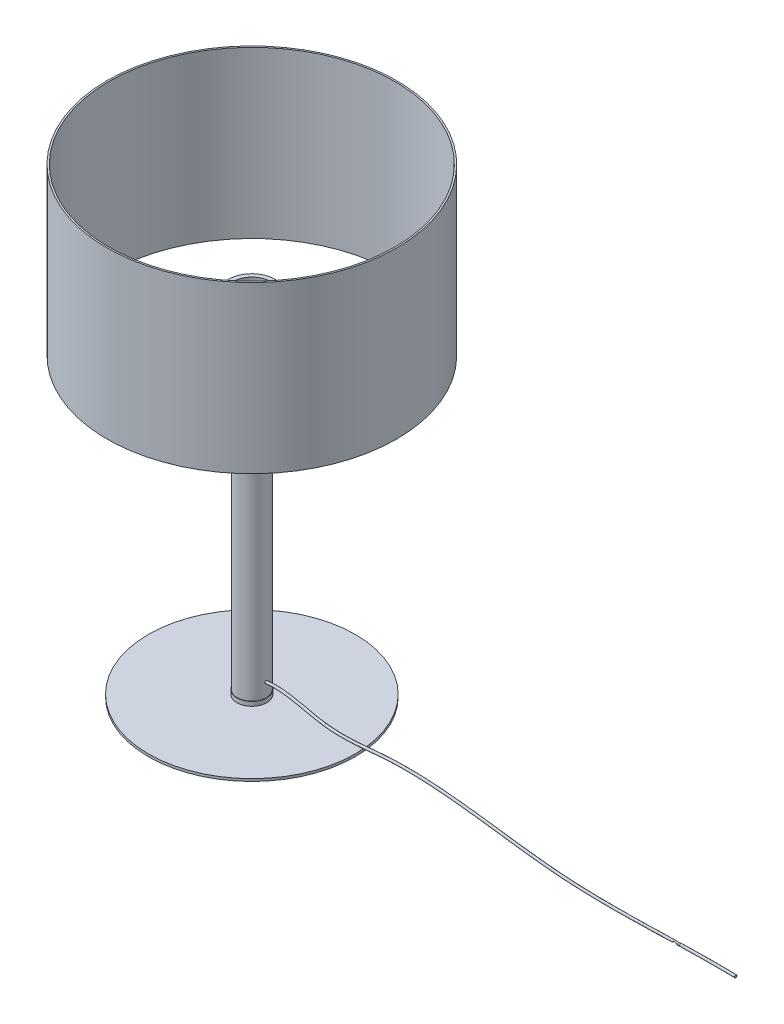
ISO-10303-21;
HEADER;
FILE_DESCRIPTION(('STEP AP214'),'2;1');
FILE_NAME('part.step','',(''),(''),'','','');
FILE_SCHEMA(('AUTOMOTIVE_DESIGN { 1 0 10303 214 1 1 1 1 }'));
ENDSEC;
DATA;
#1=APPLICATION_CONTEXT('core data for automotive mechanical design processes');
#2=APPLICATION_PROTOCOL_DEFINITION('international standard','automotive_design',2000,#1);
#3=PRODUCT_CONTEXT('',#1,'mechanical');
#4=PRODUCT('Part','Part','',(#3));
#5=PRODUCT_RELATED_PRODUCT_CATEGORY('part','',(#4));
#6=PRODUCT_DEFINITION_FORMATION('','',#4);
#7=PRODUCT_DEFINITION_CONTEXT('part definition',#1,'design');
#8=PRODUCT_DEFINITION('design','',#6,#7);
#9=PRODUCT_DEFINITION_SHAPE('','',#8);
#10=(LENGTH_UNIT() NAMED_UNIT(*) SI_UNIT(.MILLI.,.METRE.));
#11=(NAMED_UNIT(*) PLANE_ANGLE_UNIT() SI_UNIT($,.RADIAN.));
#12=(NAMED_UNIT(*) SI_UNIT($,.STERADIAN.) SOLID_ANGLE_UNIT());
#13=UNCERTAINTY_MEASURE_WITH_UNIT(LENGTH_MEASURE(1.E-05),#10,'distance_accuracy_value','');
#14=(GEOMETRIC_REPRESENTATION_CONTEXT(3) GLOBAL_UNCERTAINTY_ASSIGNED_CONTEXT((#13)) GLOBAL_UNIT_ASSIGNED_CONTEXT((#10,
#11,#12)) REPRESENTATION_CONTEXT('',''));
#15=CARTESIAN_POINT('',(0.,0.,0.));
#16=DIRECTION('',(0.,0.,1.));
#17=DIRECTION('',(1.,0.,0.));
#18=AXIS2_PLACEMENT_3D('',#15,#16,#17);
#19=CARTESIAN_POINT('',(-16.6050794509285,407.617185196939,353.));
#20=DIRECTION('',(0.,1.,0.));
#21=DIRECTION('',(0.052935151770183,0.,0.998597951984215));
#22=AXIS2_PLACEMENT_3D('',#19,#20,#21);
#23=PLANE('',#22);
#24=CARTESIAN_POINT('',(-16.6050794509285,407.617185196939,353.));
#25=DIRECTION('',(0.,1.,0.));
#26=DIRECTION('',(0.052935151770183,0.,0.998597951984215));
#27=AXIS2_PLACEMENT_3D('',#24,#25,#26);
#28=CIRCLE('',#27,175.);
#29=CARTESIAN_POINT('',(-7.34142789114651,407.617185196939,527.754641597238));
#30=VERTEX_POINT('',#29);
#31=EDGE_CURVE('P0_E9',#30,#30,#28,.T.);
#32=ORIENTED_EDGE('',*,*,#31,.T.);
#33=EDGE_LOOP('',(#32));
#34=FACE_BOUND('',#33,.T.);
#35=CARTESIAN_POINT('',(-16.6050794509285,407.617185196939,353.));
#36=DIRECTION('',(0.,1.,0.));
#37=DIRECTION('',(0.052935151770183,0.,0.998597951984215));
#38=AXIS2_PLACEMENT_3D('',#35,#36,#37);
#39=CIRCLE('',#38,173.);
#40=CARTESIAN_POINT('',(-7.44729819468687,407.617185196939,525.757445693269));
#41=VERTEX_POINT('',#40);
#42=EDGE_CURVE('P0_E25',#41,#41,#39,.T.);
#43=ORIENTED_EDGE('',*,*,#42,.F.);
#44=EDGE_LOOP('',(#43));
#45=FACE_BOUND('',#44,.T.);
#46=ADVANCED_FACE('P0_F14',(#34,#45),#23,.T.);
#47=CARTESIAN_POINT('',(-16.6050794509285,207.617185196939,353.));
#48=DIRECTION('',(0.,1.,0.));
#49=DIRECTION('',(0.052935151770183,0.,0.998597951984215));
#50=AXIS2_PLACEMENT_3D('',#47,#48,#49);
#51=PLANE('',#50);
#52=CARTESIAN_POINT('',(-16.6050794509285,207.617185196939,353.));
#53=DIRECTION('',(0.,1.,0.));
#54=DIRECTION('',(0.052935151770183,0.,0.998597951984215));
#55=AXIS2_PLACEMENT_3D('',#52,#53,#54);
#56=CIRCLE('',#55,175.);
#57=CARTESIAN_POINT('',(-7.34142789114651,207.617185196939,527.754641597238));
#58=VERTEX_POINT('',#57);
#59=EDGE_CURVE('P0_E18',#58,#58,#56,.T.);
#60=ORIENTED_EDGE('',*,*,#59,.F.);
#61=EDGE_LOOP('',(#60));
#62=FACE_BOUND('',#61,.T.);
#63=CARTESIAN_POINT('',(-16.6050794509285,207.617185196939,353.));
#64=DIRECTION('',(0.,1.,0.));
#65=DIRECTION('',(0.052935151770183,0.,0.998597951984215));
#66=AXIS2_PLACEMENT_3D('',#63,#64,#65);
#67=CIRCLE('',#66,173.);
#68=CARTESIAN_POINT('',(-7.44729819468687,207.617185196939,525.757445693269));
#69=VERTEX_POINT('',#68);
#70=EDGE_CURVE('P0_E27',#69,#69,#67,.T.);
#71=ORIENTED_EDGE('',*,*,#70,.T.);
#72=EDGE_LOOP('',(#71));
#73=FACE_BOUND('',#72,.T.);
#74=ADVANCED_FACE('P0_F37',(#62,#73),#51,.F.);
#75=CARTESIAN_POINT('',(-16.6050794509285,407.617185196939,353.));
#76=DIRECTION('',(0.,-1.,0.));
#77=DIRECTION('',(-0.052935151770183,0.,-0.998597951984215));
#78=AXIS2_PLACEMENT_3D('',#75,#76,#77);
#79=CYLINDRICAL_SURFACE('',#78,175.);
#80=ORIENTED_EDGE('',*,*,#31,.F.);
#81=EDGE_LOOP('',(#80));
#82=FACE_BOUND('',#81,.T.);
#83=ORIENTED_EDGE('',*,*,#59,.T.);
#84=EDGE_LOOP('',(#83));
#85=FACE_BOUND('',#84,.T.);
#86=ADVANCED_FACE('P0_F16',(#82,#85),#79,.T.);
#87=CARTESIAN_POINT('',(-16.6050794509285,407.617185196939,353.));
#88=DIRECTION('',(0.,-1.,0.));
#89=DIRECTION('',(-0.052935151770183,0.,-0.998597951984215));
#90=AXIS2_PLACEMENT_3D('',#87,#88,#89);
#91=CYLINDRICAL_SURFACE('',#90,173.);
#92=ORIENTED_EDGE('',*,*,#42,.T.);
#93=EDGE_LOOP('',(#92));
#94=FACE_BOUND('',#93,.T.);
#95=ORIENTED_EDGE('',*,*,#70,.F.);
#96=EDGE_LOOP('',(#95));
#97=FACE_BOUND('',#96,.T.);
#98=ADVANCED_FACE('P0_F33',(#94,#97),#91,.F.);
#99=CLOSED_SHELL('',(#46,#74,#86,#98));
#100=MANIFOLD_SOLID_BREP('P0_B1',#99);
#101=CARTESIAN_POINT('',(-16.6050794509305,273.323589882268,353.000000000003));
#102=DIRECTION('',(0.,-1.,0.));
#103=DIRECTION('',(0.,0.,-1.));
#104=AXIS2_PLACEMENT_3D('',#101,#102,#103);
#105=PLANE('',#104);
#106=CARTESIAN_POINT('',(-16.6050794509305,273.323589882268,353.000000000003));
#107=DIRECTION('',(0.,1.,0.));
#108=DIRECTION('',(0.,0.,1.));
#109=AXIS2_PLACEMENT_3D('',#106,#107,#108);
#110=CIRCLE('',#109,23.);
#111=CARTESIAN_POINT('',(-16.6050794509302,273.323589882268,376.000000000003));
#112=VERTEX_POINT('',#111);
#113=EDGE_CURVE('P1_E44',#112,#112,#110,.T.);
#114=ORIENTED_EDGE('',*,*,#113,.F.);
#115=EDGE_LOOP('',(#114));
#116=FACE_BOUND('',#115,.T.);
#117=CARTESIAN_POINT('',(-16.6050794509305,273.323589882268,353.000000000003));
#118=DIRECTION('',(0.,-1.,0.));
#119=DIRECTION('',(0.,0.,-1.));
#120=AXIS2_PLACEMENT_3D('',#117,#118,#119);
#121=CIRCLE('',#120,28.);
#122=CARTESIAN_POINT('',(-16.6050794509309,273.323589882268,325.000000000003));
#123=VERTEX_POINT('',#122);
#124=EDGE_CURVE('P1_E10',#123,#123,#121,.T.);
#125=ORIENTED_EDGE('',*,*,#124,.F.);
#126=EDGE_LOOP('',(#125));
#127=FACE_BOUND('',#126,.T.);
#128=ADVANCED_FACE('P1_F15',(#116,#127),#105,.F.);
#129=CARTESIAN_POINT('',(-16.6050794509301,229.302765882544,353.000000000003));
#130=DIRECTION('',(0.,-1.,0.));
#131=DIRECTION('',(0.,0.,-1.));
#132=AXIS2_PLACEMENT_3D('',#129,#130,#131);
#133=CYLINDRICAL_SURFACE('',#132,28.);
#134=CARTESIAN_POINT('',(-16.6050794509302,239.323589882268,353.000000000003));
#135=DIRECTION('',(0.,-1.,0.));
#136=DIRECTION('',(0.,0.,-1.));
#137=AXIS2_PLACEMENT_3D('',#134,#135,#136);
#138=CIRCLE('',#137,28.);
#139=CARTESIAN_POINT('',(-16.6050794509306,239.323589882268,325.000000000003));
#140=VERTEX_POINT('',#139);
#141=EDGE_CURVE('P1_E21',#140,#140,#138,.T.);
#142=ORIENTED_EDGE('',*,*,#141,.F.);
#143=EDGE_LOOP('',(#142));
#144=FACE_BOUND('',#143,.T.);
#145=ORIENTED_EDGE('',*,*,#124,.T.);
#146=EDGE_LOOP('',(#145));
#147=FACE_BOUND('',#146,.T.);
#148=ADVANCED_FACE('P1_F79',(#144,#147),#133,.T.);
#149=CARTESIAN_POINT('',(-16.6050794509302,239.323589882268,353.000000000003));
#150=DIRECTION('',(0.,-1.,0.));
#151=DIRECTION('',(0.,0.,-1.));
#152=AXIS2_PLACEMENT_3D('',#149,#150,#151);
#153=TOROIDAL_SURFACE('',#152,24.,4.);
#154=CARTESIAN_POINT('',(-16.6050794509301,235.323589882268,353.000000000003));
#155=DIRECTION('',(0.,-1.,0.));
#156=DIRECTION('',(0.,0.,-1.));
#157=AXIS2_PLACEMENT_3D('',#154,#155,#156);
#158=CIRCLE('',#157,24.);
#159=CARTESIAN_POINT('',(-16.6050794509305,235.323589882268,329.000000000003));
#160=VERTEX_POINT('',#159);
#161=EDGE_CURVE('P1_E25',#160,#160,#158,.T.);
#162=ORIENTED_EDGE('',*,*,#161,.F.);
#163=EDGE_LOOP('',(#162));
#164=FACE_BOUND('',#163,.T.);
#165=ORIENTED_EDGE('',*,*,#141,.T.);
#166=EDGE_LOOP('',(#165));
#167=FACE_BOUND('',#166,.T.);
#168=ADVANCED_FACE('P1_F84',(#164,#167),#153,.T.);
#169=CARTESIAN_POINT('',(7.39492054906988,235.323589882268,353.000000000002));
#170=DIRECTION('',(0.,1.,0.));
#171=DIRECTION('',(0.,0.,1.));
#172=AXIS2_PLACEMENT_3D('',#169,#170,#171);
#173=PLANE('',#172);
#174=CARTESIAN_POINT('',(-16.6050794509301,235.323589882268,353.000000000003));
#175=DIRECTION('',(0.,-1.,0.));
#176=DIRECTION('',(0.,0.,-1.));
#177=AXIS2_PLACEMENT_3D('',#174,#175,#176);
#178=CIRCLE('',#177,23.);
#179=CARTESIAN_POINT('',(-16.6050794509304,235.323589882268,330.000000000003));
#180=VERTEX_POINT('',#179);
#181=EDGE_CURVE('P1_E29',#180,#180,#178,.T.);
#182=ORIENTED_EDGE('',*,*,#181,.F.);
#183=EDGE_LOOP('',(#182));
#184=FACE_BOUND('',#183,.T.);
#185=ORIENTED_EDGE('',*,*,#161,.T.);
#186=EDGE_LOOP('',(#185));
#187=FACE_BOUND('',#186,.T.);
#188=ADVANCED_FACE('P1_F89',(#184,#187),#173,.F.);
#189=CARTESIAN_POINT('',(-16.6050794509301,235.323589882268,353.000000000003));
#190=DIRECTION('',(0.,1.,0.));
#191=DIRECTION('',(0.,0.,1.));
#192=AXIS2_PLACEMENT_3D('',#189,#190,#191);
#193=CONICAL_SURFACE('',#192,23.,0.0661072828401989);
#194=CARTESIAN_POINT('',(-16.6050794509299,216.60539221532,353.000000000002));
#195=DIRECTION('',(0.,-1.,0.));
#196=DIRECTION('',(0.,0.,-1.));
#197=AXIS2_PLACEMENT_3D('',#194,#195,#196);
#198=CIRCLE('',#197,21.7607850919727);
#199=CARTESIAN_POINT('',(-16.6050794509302,216.60539221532,331.23921490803));
#200=VERTEX_POINT('',#199);
#201=EDGE_CURVE('P1_E34',#200,#200,#198,.T.);
#202=ORIENTED_EDGE('',*,*,#201,.F.);
#203=EDGE_LOOP('',(#202));
#204=FACE_BOUND('',#203,.T.);
#205=ORIENTED_EDGE('',*,*,#181,.T.);
#206=EDGE_LOOP('',(#205));
#207=FACE_BOUND('',#206,.T.);
#208=ADVANCED_FACE('P1_F95',(#204,#207),#193,.T.);
#209=CARTESIAN_POINT('',(-16.6050794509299,216.935687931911,353.000000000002));
#210=DIRECTION('',(0.,-1.,0.));
#211=DIRECTION('',(0.,0.,-1.));
#212=AXIS2_PLACEMENT_3D('',#209,#210,#211);
#213=TOROIDAL_SURFACE('',#212,16.771706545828,5.);
#214=CARTESIAN_POINT('',(-16.6050794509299,214.241434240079,353.000000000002));
#215=DIRECTION('',(0.,-1.,0.));
#216=DIRECTION('',(0.,0.,-1.));
#217=AXIS2_PLACEMENT_3D('',#214,#215,#216);
#218=CIRCLE('',#217,20.9837128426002);
#219=CARTESIAN_POINT('',(-16.6050794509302,214.241434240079,332.016287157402));
#220=VERTEX_POINT('',#219);
#221=EDGE_CURVE('P1_E37',#220,#220,#218,.T.);
#222=ORIENTED_EDGE('',*,*,#221,.F.);
#223=EDGE_LOOP('',(#222));
#224=FACE_BOUND('',#223,.T.);
#225=ORIENTED_EDGE('',*,*,#201,.T.);
#226=EDGE_LOOP('',(#225));
#227=FACE_BOUND('',#226,.T.);
#228=ADVANCED_FACE('P1_F99',(#224,#227),#213,.T.);
#229=CARTESIAN_POINT('',(-16.6050794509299,214.241434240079,353.000000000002));
#230=DIRECTION('',(0.,1.,0.));
#231=DIRECTION('',(0.,0.,1.));
#232=AXIS2_PLACEMENT_3D('',#229,#230,#231);
#233=CONICAL_SURFACE('',#232,20.9837128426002,0.569072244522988);
#234=CARTESIAN_POINT('',(-16.6050794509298,203.323589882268,353.000000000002));
#235=DIRECTION('',(0.,-1.,0.));
#236=DIRECTION('',(0.,0.,-1.));
#237=AXIS2_PLACEMENT_3D('',#234,#235,#236);
#238=CIRCLE('',#237,14.);
#239=CARTESIAN_POINT('',(-16.60507945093,203.323589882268,339.000000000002));
#240=VERTEX_POINT('',#239);
#241=EDGE_CURVE('P1_E40',#240,#240,#238,.T.);
#242=ORIENTED_EDGE('',*,*,#241,.F.);
#243=EDGE_LOOP('',(#242));
#244=FACE_BOUND('',#243,.T.);
#245=ORIENTED_EDGE('',*,*,#221,.T.);
#246=EDGE_LOOP('',(#245));
#247=FACE_BOUND('',#246,.T.);
#248=ADVANCED_FACE('P1_F103',(#244,#247),#233,.T.);
#249=CARTESIAN_POINT('',(-2.60507945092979,203.323589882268,353.000000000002));
#250=DIRECTION('',(0.,1.,0.));
#251=DIRECTION('',(0.,0.,1.));
#252=AXIS2_PLACEMENT_3D('',#249,#250,#251);
#253=PLANE('',#252);
#254=ORIENTED_EDGE('',*,*,#241,.T.);
#255=EDGE_LOOP('',(#254));
#256=FACE_BOUND('',#255,.T.);
#257=ADVANCED_FACE('P1_F73',(#256),#253,.F.);
#258=CARTESIAN_POINT('',(-16.6050794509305,268.323589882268,353.000000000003));
#259=DIRECTION('',(0.,1.,0.));
#260=DIRECTION('',(0.,0.,1.));
#261=AXIS2_PLACEMENT_3D('',#258,#259,#260);
#262=CYLINDRICAL_SURFACE('',#261,23.);
#263=CARTESIAN_POINT('',(-16.6050794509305,268.323589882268,353.000000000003));
#264=DIRECTION('',(0.,1.,0.));
#265=DIRECTION('',(0.,0.,1.));
#266=AXIS2_PLACEMENT_3D('',#263,#264,#265);
#267=CIRCLE('',#266,23.);
#268=CARTESIAN_POINT('',(-16.6050794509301,268.323589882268,376.000000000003));
#269=VERTEX_POINT('',#268);
#270=EDGE_CURVE('P1_E43',#269,#269,#267,.T.);
#271=ORIENTED_EDGE('',*,*,#270,.F.);
#272=EDGE_LOOP('',(#271));
#273=FACE_BOUND('',#272,.T.);
#274=ORIENTED_EDGE('',*,*,#113,.T.);
#275=EDGE_LOOP('',(#274));
#276=FACE_BOUND('',#275,.T.);
#277=ADVANCED_FACE('P1_F67',(#273,#276),#262,.F.);
#278=CARTESIAN_POINT('',(-16.6050794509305,268.323589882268,353.000000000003));
#279=DIRECTION('',(0.,1.,0.));
#280=DIRECTION('',(0.,0.,1.));
#281=AXIS2_PLACEMENT_3D('',#278,#279,#280);
#282=PLANE('',#281);
#283=CARTESIAN_POINT('',(-16.6050794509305,268.323589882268,353.000000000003));
#284=DIRECTION('',(0.,1.,0.));
#285=DIRECTION('',(0.,0.,1.));
#286=AXIS2_PLACEMENT_3D('',#283,#284,#285);
#287=CIRCLE('',#286,12.);
#288=CARTESIAN_POINT('',(-16.6050794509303,268.323589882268,365.000000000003));
#289=VERTEX_POINT('',#288);
#290=EDGE_CURVE('P1_E50',#289,#289,#287,.T.);
#291=ORIENTED_EDGE('',*,*,#290,.F.);
#292=EDGE_LOOP('',(#291));
#293=FACE_BOUND('',#292,.T.);
#294=ORIENTED_EDGE('',*,*,#270,.T.);
#295=EDGE_LOOP('',(#294));
#296=FACE_BOUND('',#295,.T.);
#297=ADVANCED_FACE('P1_F61',(#293,#296),#282,.T.);
#298=CARTESIAN_POINT('',(-16.6050794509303,248.323589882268,353.000000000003));
#299=DIRECTION('',(0.,1.,0.));
#300=DIRECTION('',(0.,0.,1.));
#301=AXIS2_PLACEMENT_3D('',#298,#299,#300);
#302=CYLINDRICAL_SURFACE('',#301,12.);
#303=CARTESIAN_POINT('',(-16.6050794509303,248.323589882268,353.000000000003));
#304=DIRECTION('',(0.,1.,0.));
#305=DIRECTION('',(0.,0.,1.));
#306=AXIS2_PLACEMENT_3D('',#303,#304,#305);
#307=CIRCLE('',#306,12.);
#308=CARTESIAN_POINT('',(-16.6050794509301,248.323589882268,365.000000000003));
#309=VERTEX_POINT('',#308);
#310=EDGE_CURVE('P1_E47',#309,#309,#307,.T.);
#311=ORIENTED_EDGE('',*,*,#310,.F.);
#312=EDGE_LOOP('',(#311));
#313=FACE_BOUND('',#312,.T.);
#314=ORIENTED_EDGE('',*,*,#290,.T.);
#315=EDGE_LOOP('',(#314));
#316=FACE_BOUND('',#315,.T.);
#317=ADVANCED_FACE('P1_F58',(#313,#316),#302,.F.);
#318=CARTESIAN_POINT('',(-16.6050794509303,248.323589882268,353.000000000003));
#319=DIRECTION('',(0.,1.,0.));
#320=DIRECTION('',(0.,0.,1.));
#321=AXIS2_PLACEMENT_3D('',#318,#319,#320);
#322=PLANE('',#321);
#323=ORIENTED_EDGE('',*,*,#310,.T.);
#324=EDGE_LOOP('',(#323));
#325=FACE_BOUND('',#324,.T.);
#326=ADVANCED_FACE('P1_F56',(#325),#322,.T.);
#327=CLOSED_SHELL('',(#128,#148,#168,#188,#208,#228,#248,#257,#277,#297,#317,#326));
#328=MANIFOLD_SOLID_BREP('P1_B1',#327);
#329=CARTESIAN_POINT('',(-56.6050794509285,100.323589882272,353.));
#330=DIRECTION('',(1.,0.,0.));
#331=DIRECTION('',(0.,0.,-1.));
#332=AXIS2_PLACEMENT_3D('',#329,#330,#331);
#333=CYLINDRICAL_SURFACE('',#332,1.5);
#334=CARTESIAN_POINT('',(-56.1050794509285,100.323589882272,353.));
#335=DIRECTION('',(-1.,0.,0.));
#336=DIRECTION('',(0.,0.,1.));
#337=AXIS2_PLACEMENT_3D('',#334,#335,#336);
#338=CIRCLE('',#337,1.5);
#339=CARTESIAN_POINT('',(-56.1050794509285,100.323589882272,351.5));
#340=VERTEX_POINT('',#339);
#341=EDGE_CURVE('P2_E10',#340,#340,#338,.F.);
#342=CARTESIAN_POINT('',(-41.6050794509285,100.323589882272,353.));
#343=DIRECTION('',(-1.,0.,0.));
#344=DIRECTION('',(0.,0.,1.));
#345=AXIS2_PLACEMENT_3D('',#342,#343,#344);
#346=CIRCLE('',#345,1.5);
#347=CARTESIAN_POINT('',(-41.6050794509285,100.323589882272,351.5));
#348=VERTEX_POINT('',#347);
#349=EDGE_CURVE('P2_E26',#348,#348,#346,.T.);
#350=CARTESIAN_POINT('',(-56.1050794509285,100.323589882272,351.5));
#351=CARTESIAN_POINT('',(-55.9540377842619,100.323589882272,351.5));
#352=CARTESIAN_POINT('',(-55.8029961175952,100.323589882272,351.5));
#353=CARTESIAN_POINT('',(-55.5009127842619,100.323589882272,351.5));
#354=CARTESIAN_POINT('',(-55.3498711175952,100.323589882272,351.5));
#355=CARTESIAN_POINT('',(-55.0477877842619,100.323589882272,351.5));
#356=CARTESIAN_POINT('',(-54.8967461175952,100.323589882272,351.5));
#357=CARTESIAN_POINT('',(-54.5946627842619,100.323589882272,351.5));
#358=CARTESIAN_POINT('',(-54.4436211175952,100.323589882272,351.5));
#359=CARTESIAN_POINT('',(-54.1415377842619,100.323589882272,351.5));
#360=CARTESIAN_POINT('',(-53.9904961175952,100.323589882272,351.5));
#361=CARTESIAN_POINT('',(-53.6884127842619,100.323589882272,351.5));
#362=CARTESIAN_POINT('',(-53.5373711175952,100.323589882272,351.5));
#363=CARTESIAN_POINT('',(-53.2352877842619,100.323589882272,351.5));
#364=CARTESIAN_POINT('',(-53.0842461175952,100.323589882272,351.5));
#365=CARTESIAN_POINT('',(-52.7821627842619,100.323589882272,351.5));
#366=CARTESIAN_POINT('',(-52.6311211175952,100.323589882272,351.5));
#367=CARTESIAN_POINT('',(-52.3290377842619,100.323589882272,351.5));
#368=CARTESIAN_POINT('',(-52.1779961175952,100.323589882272,351.5));
#369=CARTESIAN_POINT('',(-51.8759127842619,100.323589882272,351.5));
#370=CARTESIAN_POINT('',(-51.7248711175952,100.323589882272,351.5));
#371=CARTESIAN_POINT('',(-51.4227877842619,100.323589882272,351.5));
#372=CARTESIAN_POINT('',(-51.2717461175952,100.323589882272,351.5));
#373=CARTESIAN_POINT('',(-50.9696627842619,100.323589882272,351.5));
#374=CARTESIAN_POINT('',(-50.8186211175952,100.323589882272,351.5));
#375=CARTESIAN_POINT('',(-50.5165377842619,100.323589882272,351.5));
#376=CARTESIAN_POINT('',(-50.3654961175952,100.323589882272,351.5));
#377=CARTESIAN_POINT('',(-50.0634127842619,100.323589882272,351.5));
#378=CARTESIAN_POINT('',(-49.9123711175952,100.323589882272,351.5));
#379=CARTESIAN_POINT('',(-49.6102877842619,100.323589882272,351.5));
#380=CARTESIAN_POINT('',(-49.4592461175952,100.323589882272,351.5));
#381=CARTESIAN_POINT('',(-49.1571627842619,100.323589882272,351.5));
#382=CARTESIAN_POINT('',(-49.0061211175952,100.323589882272,351.5));
#383=CARTESIAN_POINT('',(-48.7040377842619,100.323589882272,351.5));
#384=CARTESIAN_POINT('',(-48.5529961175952,100.323589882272,351.5));
#385=CARTESIAN_POINT('',(-48.2509127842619,100.323589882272,351.5));
#386=CARTESIAN_POINT('',(-48.0998711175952,100.323589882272,351.5));
#387=CARTESIAN_POINT('',(-47.7977877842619,100.323589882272,351.5));
#388=CARTESIAN_POINT('',(-47.6467461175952,100.323589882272,351.5));
#389=CARTESIAN_POINT('',(-47.3446627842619,100.323589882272,351.5));
#390=CARTESIAN_POINT('',(-47.1936211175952,100.323589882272,351.5));
#391=CARTESIAN_POINT('',(-46.8915377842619,100.323589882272,351.5));
#392=CARTESIAN_POINT('',(-46.7404961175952,100.323589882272,351.5));
#393=CARTESIAN_POINT('',(-46.4384127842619,100.323589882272,351.5));
#394=CARTESIAN_POINT('',(-46.2873711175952,100.323589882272,351.5));
#395=CARTESIAN_POINT('',(-45.9852877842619,100.323589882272,351.5));
#396=CARTESIAN_POINT('',(-45.8342461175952,100.323589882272,351.5));
#397=CARTESIAN_POINT('',(-45.5321627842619,100.323589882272,351.5));
#398=CARTESIAN_POINT('',(-45.3811211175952,100.323589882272,351.5));
#399=CARTESIAN_POINT('',(-45.0790377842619,100.323589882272,351.5));
#400=CARTESIAN_POINT('',(-44.9279961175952,100.323589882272,351.5));
#401=CARTESIAN_POINT('',(-44.6259127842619,100.323589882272,351.5));
#402=CARTESIAN_POINT('',(-44.4748711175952,100.323589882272,351.5));
#403=CARTESIAN_POINT('',(-44.1727877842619,100.323589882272,351.5));
#404=CARTESIAN_POINT('',(-44.0217461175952,100.323589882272,351.5));
#405=CARTESIAN_POINT('',(-43.7196627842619,100.323589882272,351.5));
#406=CARTESIAN_POINT('',(-43.5686211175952,100.323589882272,351.5));
#407=CARTESIAN_POINT('',(-43.2665377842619,100.323589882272,351.5));
#408=CARTESIAN_POINT('',(-43.1154961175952,100.323589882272,351.5));
#409=CARTESIAN_POINT('',(-42.8134127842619,100.323589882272,351.5));
#410=CARTESIAN_POINT('',(-42.6623711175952,100.323589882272,351.5));
#411=CARTESIAN_POINT('',(-42.3602877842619,100.323589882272,351.5));
#412=CARTESIAN_POINT('',(-42.2092461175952,100.323589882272,351.5));
#413=CARTESIAN_POINT('',(-41.9071627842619,100.323589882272,351.5));
#414=CARTESIAN_POINT('',(-41.7561211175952,100.323589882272,351.5));
#415=CARTESIAN_POINT('',(-41.6050794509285,100.323589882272,351.5));
#416=B_SPLINE_CURVE_WITH_KNOTS('',3,(#350,#351,#352,#353,#354,#355,#356,#357,#358,#359,#360,
#361,#362,#363,#364,#365,#366,#367,#368,#369,#370,#371,#372,#373,#374,#375,#376,#377,#378,#379,
#380,#381,#382,#383,#384,#385,#386,#387,#388,#389,#390,#391,#392,#393,#394,#395,#396,#397,#398,
#399,#400,#401,#402,#403,#404,#405,#406,#407,#408,#409,#410,#411,#412,#413,#414,#415),
.UNSPECIFIED.,.F.,.F.,(4,2,2,2,2,2,2,2,2,2,2,2,2,2,2,2,2,2,2,2,2,2,2,2,2,2,2,2,2,2,2,2,4),(0.,
0.453125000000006,0.906250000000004,1.359375,1.8125,2.265625,2.71875000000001,3.171875,3.625,
4.078125,4.53125,4.984375,5.4375,5.890625,6.34375,6.796875,7.25,7.703125,8.15625,8.609375,
9.0625,9.515625,9.96875,10.421875,10.875,11.328125,11.78125,12.234375,12.6875,13.140625,
13.59375,14.046875,14.5),.UNSPECIFIED.);
#417=EDGE_CURVE('P2_BSEAM15',#340,#348,#416,.T.);
#418=ORIENTED_EDGE('',*,*,#341,.T.);
#419=ORIENTED_EDGE('',*,*,#349,.T.);
#420=ORIENTED_EDGE('',*,*,#417,.T.);
#421=ORIENTED_EDGE('',*,*,#417,.F.);
#422=EDGE_LOOP('',(#418,#420,#419,#421));
#423=FACE_BOUND('',#422,.T.);
#424=ADVANCED_FACE('P2_F15',(#423),#333,.T.);
#425=CARTESIAN_POINT('',(-56.6050794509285,100.323589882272,353.));
#426=DIRECTION('',(-1.,0.,0.));
#427=DIRECTION('',(0.,0.,1.));
#428=AXIS2_PLACEMENT_3D('',#425,#426,#427);
#429=PLANE('',#428);
#430=CARTESIAN_POINT('',(-56.6050794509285,100.323589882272,353.));
#431=DIRECTION('',(-1.,0.,0.));
#432=DIRECTION('',(0.,0.,1.));
#433=AXIS2_PLACEMENT_3D('',#430,#431,#432);
#434=CIRCLE('',#433,1.);
#435=CARTESIAN_POINT('',(-56.6050794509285,100.323589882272,354.));
#436=VERTEX_POINT('',#435);
#437=EDGE_CURVE('P2_E22',#436,#436,#434,.T.);
#438=ORIENTED_EDGE('',*,*,#437,.T.);
#439=EDGE_LOOP('',(#438));
#440=FACE_BOUND('',#439,.T.);
#441=ADVANCED_FACE('P2_F36',(#440),#429,.T.);
#442=CARTESIAN_POINT('',(-41.6050794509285,100.323589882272,353.));
#443=DIRECTION('',(-1.,0.,0.));
#444=DIRECTION('',(0.,0.,1.));
#445=AXIS2_PLACEMENT_3D('',#442,#443,#444);
#446=PLANE('',#445);
#447=ORIENTED_EDGE('',*,*,#349,.F.);
#448=EDGE_LOOP('',(#447));
#449=FACE_BOUND('',#448,.T.);
#450=ADVANCED_FACE('P2_F34',(#449),#446,.F.);
#451=CARTESIAN_POINT('',(-56.1050794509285,100.323589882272,353.));
#452=DIRECTION('',(-1.,0.,0.));
#453=DIRECTION('',(0.,0.,1.));
#454=AXIS2_PLACEMENT_3D('',#451,#452,#453);
#455=TOROIDAL_SURFACE('',#454,1.,0.5);
#456=ORIENTED_EDGE('',*,*,#341,.F.);
#457=EDGE_LOOP('',(#456));
#458=FACE_BOUND('',#457,.T.);
#459=ORIENTED_EDGE('',*,*,#437,.F.);
#460=EDGE_LOOP('',(#459));
#461=FACE_BOUND('',#460,.T.);
#462=ADVANCED_FACE('P2_F17',(#458,#461),#455,.T.);
#463=CLOSED_SHELL('',(#424,#441,#450,#462));
#464=MANIFOLD_SOLID_BREP('P2_B1',#463);
#465=CARTESIAN_POINT('',(-41.6050794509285,100.323589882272,353.));
#466=DIRECTION('',(1.,0.,0.));
#467=DIRECTION('',(0.,0.,-1.));
#468=AXIS2_PLACEMENT_3D('',#465,#466,#467);
#469=CYLINDRICAL_SURFACE('',#468,5.);
#470=CARTESIAN_POINT('',(-39.6050794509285,100.323589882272,353.));
#471=DIRECTION('',(1.,0.,0.));
#472=DIRECTION('',(0.,0.,-1.));
#473=AXIS2_PLACEMENT_3D('',#470,#471,#472);
#474=CIRCLE('',#473,5.);
#475=CARTESIAN_POINT('',(-39.6050794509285,100.323589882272,348.));
#476=VERTEX_POINT('',#475);
#477=EDGE_CURVE('P3_E22',#476,#476,#474,.T.);
#478=ORIENTED_EDGE('',*,*,#477,.T.);
#479=EDGE_LOOP('',(#478));
#480=FACE_BOUND('',#479,.T.);
#481=CARTESIAN_POINT('',(-16.6050794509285,100.323589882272,353.));
#482=DIRECTION('',(1.,0.,0.));
#483=DIRECTION('',(0.,0.,-1.));
#484=AXIS2_PLACEMENT_3D('',#481,#482,#483);
#485=CIRCLE('',#484,5.);
#486=CARTESIAN_POINT('',(-16.6050794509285,100.323589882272,348.));
#487=VERTEX_POINT('',#486);
#488=EDGE_CURVE('P3_E26',#487,#487,#485,.T.);
#489=ORIENTED_EDGE('',*,*,#488,.F.);
#490=EDGE_LOOP('',(#489));
#491=FACE_BOUND('',#490,.T.);
#492=ADVANCED_FACE('P3_F15',(#480,#491),#469,.T.);
#493=CARTESIAN_POINT('',(-41.6050794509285,100.323589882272,353.));
#494=DIRECTION('',(1.,0.,0.));
#495=DIRECTION('',(0.,0.,-1.));
#496=AXIS2_PLACEMENT_3D('',#493,#494,#495);
#497=PLANE('',#496);
#498=CARTESIAN_POINT('',(-41.6050794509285,100.323589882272,353.));
#499=DIRECTION('',(1.,0.,0.));
#500=DIRECTION('',(0.,0.,-1.));
#501=AXIS2_PLACEMENT_3D('',#498,#499,#500);
#502=CIRCLE('',#501,3.);
#503=CARTESIAN_POINT('',(-41.6050794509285,100.323589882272,350.));
#504=VERTEX_POINT('',#503);
#505=EDGE_CURVE('P3_E10',#504,#504,#502,.F.);
#506=ORIENTED_EDGE('',*,*,#505,.T.);
#507=EDGE_LOOP('',(#506));
#508=FACE_BOUND('',#507,.T.);
#509=ADVANCED_FACE('P3_F36',(#508),#497,.F.);
#510=CARTESIAN_POINT('',(-16.6050794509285,100.323589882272,353.));
#511=DIRECTION('',(1.,0.,0.));
#512=DIRECTION('',(0.,0.,-1.));
#513=AXIS2_PLACEMENT_3D('',#510,#511,#512);
#514=PLANE('',#513);
#515=ORIENTED_EDGE('',*,*,#488,.T.);
#516=EDGE_LOOP('',(#515));
#517=FACE_BOUND('',#516,.T.);
#518=ADVANCED_FACE('P3_F33',(#517),#514,.T.);
#519=CARTESIAN_POINT('',(-39.6050794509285,100.323589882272,353.));
#520=DIRECTION('',(1.,0.,0.));
#521=DIRECTION('',(0.,0.,-1.));
#522=AXIS2_PLACEMENT_3D('',#519,#520,#521);
#523=TOROIDAL_SURFACE('',#522,3.,2.);
#524=ORIENTED_EDGE('',*,*,#505,.F.);
#525=EDGE_LOOP('',(#524));
#526=FACE_BOUND('',#525,.T.);
#527=ORIENTED_EDGE('',*,*,#477,.F.);
#528=EDGE_LOOP('',(#527));
#529=FACE_BOUND('',#528,.T.);
#530=ADVANCED_FACE('P3_F17',(#526,#529),#523,.T.);
#531=CLOSED_SHELL('',(#492,#509,#518,#530));
#532=MANIFOLD_SOLID_BREP('P3_B1',#531);
#533=CARTESIAN_POINT('',(-16.6050794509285,-129.676410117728,353.));
#534=DIRECTION('',(0.93133548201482,0.364162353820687,0.));
#535=DIRECTION('',(-0.364162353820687,0.93133548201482,0.));
#536=AXIS2_PLACEMENT_3D('',#533,#534,#535);
#537=PLANE('',#536);
#538=CARTESIAN_POINT('',(-16.6050794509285,-129.676410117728,353.));
#539=DIRECTION('',(0.93133548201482,0.364162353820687,0.));
#540=DIRECTION('',(-0.364162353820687,0.93133548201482,0.));
#541=AXIS2_PLACEMENT_3D('',#538,#539,#540);
#542=CIRCLE('',#541,1.5);
#543=CARTESIAN_POINT('',(-17.1513229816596,-128.279406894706,353.));
#544=VERTEX_POINT('',#543);
#545=EDGE_CURVE('P4_E24',#544,#544,#542,.T.);
#546=ORIENTED_EDGE('',*,*,#545,.F.);
#547=EDGE_LOOP('',(#546));
#548=FACE_BOUND('',#547,.T.);
#549=ADVANCED_FACE('P4_F17',(#548),#537,.F.);
#550=CARTESIAN_POINT('',(567.912311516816,-149.676410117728,353.));
#551=DIRECTION('',(0.999771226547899,-0.021389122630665,0.));
#552=DIRECTION('',(0.021389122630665,0.999771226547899,0.));
#553=AXIS2_PLACEMENT_3D('',#550,#551,#552);
#554=PLANE('',#553);
#555=CARTESIAN_POINT('',(567.912311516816,-149.676410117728,353.));
#556=DIRECTION('',(0.999771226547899,-0.021389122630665,0.));
#557=DIRECTION('',(0.021389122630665,0.999771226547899,0.));
#558=AXIS2_PLACEMENT_3D('',#555,#556,#557);
#559=CIRCLE('',#558,1.5);
#560=CARTESIAN_POINT('',(567.944395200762,-148.176753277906,353.));
#561=VERTEX_POINT('',#560);
#562=EDGE_CURVE('P4_E11',#561,#561,#559,.T.);
#563=ORIENTED_EDGE('',*,*,#562,.T.);
#564=EDGE_LOOP('',(#563));
#565=FACE_BOUND('',#564,.T.);
#566=ADVANCED_FACE('P4_F31',(#565),#554,.T.);
#567=CARTESIAN_POINT('',(-17.1513229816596,-128.279406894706,353.));
#568=CARTESIAN_POINT('',(-1.06483154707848,-121.989412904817,353.));
#569=CARTESIAN_POINT('',(14.4955559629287,-122.414526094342,353.));
#570=CARTESIAN_POINT('',(44.8781133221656,-127.20087929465,353.));
#571=CARTESIAN_POINT('',(59.7513551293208,-131.535320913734,353.));
#572=CARTESIAN_POINT('',(98.30262995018,-135.932307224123,353.));
#573=CARTESIAN_POINT('',(122.600422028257,-132.08522692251,353.));
#574=CARTESIAN_POINT('',(218.27401221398,-126.437710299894,353.));
#575=CARTESIAN_POINT('',(288.436056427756,-143.184178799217,353.));
#576=CARTESIAN_POINT('',(428.209535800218,-153.099440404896,353.));
#577=CARTESIAN_POINT('',(498.175882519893,-146.684124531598,353.));
#578=CARTESIAN_POINT('',(567.944395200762,-148.176753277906,353.));
#579=CARTESIAN_POINT('',(-17.1513229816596,-128.279406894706,356.));
#580=CARTESIAN_POINT('',(-1.06483154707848,-121.989412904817,356.));
#581=CARTESIAN_POINT('',(14.4955559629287,-122.414526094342,356.));
#582=CARTESIAN_POINT('',(44.8781133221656,-127.20087929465,356.));
#583=CARTESIAN_POINT('',(59.7513551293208,-131.535320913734,356.));
#584=CARTESIAN_POINT('',(98.30262995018,-135.932307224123,356.));
#585=CARTESIAN_POINT('',(122.600422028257,-132.08522692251,356.));
#586=CARTESIAN_POINT('',(218.27401221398,-126.437710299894,356.));
#587=CARTESIAN_POINT('',(288.436056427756,-143.184178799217,356.));
#588=CARTESIAN_POINT('',(428.209535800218,-153.099440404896,356.));
#589=CARTESIAN_POINT('',(498.175882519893,-146.684124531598,356.));
#590=CARTESIAN_POINT('',(567.944395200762,-148.176753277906,356.));
#591=CARTESIAN_POINT('',(-16.0588359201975,-131.073413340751,356.));
#592=CARTESIAN_POINT('',(-0.624260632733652,-125.038325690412,356.));
#593=CARTESIAN_POINT('',(14.2843365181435,-125.418249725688,356.));
#594=CARTESIAN_POINT('',(44.1556305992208,-130.124060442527,356.));
#595=CARTESIAN_POINT('',(59.06725557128,-134.476745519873,356.));
#596=CARTESIAN_POINT('',(98.5086681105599,-138.975256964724,356.));
#597=CARTESIAN_POINT('',(122.976984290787,-135.068220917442,356.));
#598=CARTESIAN_POINT('',(217.866461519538,-129.466989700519,356.));
#599=CARTESIAN_POINT('',(287.893547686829,-146.153233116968,356.));
#600=CARTESIAN_POINT('',(428.322411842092,-156.114986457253,356.));
#601=CARTESIAN_POINT('',(498.338919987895,-149.688299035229,356.));
#602=CARTESIAN_POINT('',(567.88022783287,-151.17606695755,356.));
#603=CARTESIAN_POINT('',(-16.0588359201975,-131.073413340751,353.));
#604=CARTESIAN_POINT('',(-0.624260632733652,-125.038325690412,353.));
#605=CARTESIAN_POINT('',(14.2843365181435,-125.418249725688,353.));
#606=CARTESIAN_POINT('',(44.1556305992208,-130.124060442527,353.));
#607=CARTESIAN_POINT('',(59.06725557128,-134.476745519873,353.));
#608=CARTESIAN_POINT('',(98.5086681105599,-138.975256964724,353.));
#609=CARTESIAN_POINT('',(122.976984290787,-135.068220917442,353.));
#610=CARTESIAN_POINT('',(217.866461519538,-129.466989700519,353.));
#611=CARTESIAN_POINT('',(287.893547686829,-146.153233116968,353.));
#612=CARTESIAN_POINT('',(428.322411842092,-156.114986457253,353.));
#613=CARTESIAN_POINT('',(498.338919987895,-149.688299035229,353.));
#614=CARTESIAN_POINT('',(567.88022783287,-151.17606695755,353.));
#615=CARTESIAN_POINT('',(-16.0588359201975,-131.073413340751,350.));
#616=CARTESIAN_POINT('',(-0.624260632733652,-125.038325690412,350.));
#617=CARTESIAN_POINT('',(14.2843365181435,-125.418249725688,350.));
#618=CARTESIAN_POINT('',(44.1556305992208,-130.124060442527,350.));
#619=CARTESIAN_POINT('',(59.06725557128,-134.476745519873,350.));
#620=CARTESIAN_POINT('',(98.5086681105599,-138.975256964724,350.));
#621=CARTESIAN_POINT('',(122.976984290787,-135.068220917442,350.));
#622=CARTESIAN_POINT('',(217.866461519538,-129.466989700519,350.));
#623=CARTESIAN_POINT('',(287.893547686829,-146.153233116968,350.));
#624=CARTESIAN_POINT('',(428.322411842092,-156.114986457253,350.));
#625=CARTESIAN_POINT('',(498.338919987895,-149.688299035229,350.));
#626=CARTESIAN_POINT('',(567.88022783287,-151.17606695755,350.));
#627=CARTESIAN_POINT('',(-17.1513229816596,-128.279406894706,350.));
#628=CARTESIAN_POINT('',(-1.06483154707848,-121.989412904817,350.));
#629=CARTESIAN_POINT('',(14.4955559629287,-122.414526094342,350.));
#630=CARTESIAN_POINT('',(44.8781133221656,-127.20087929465,350.));
#631=CARTESIAN_POINT('',(59.7513551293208,-131.535320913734,350.));
#632=CARTESIAN_POINT('',(98.30262995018,-135.932307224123,350.));
#633=CARTESIAN_POINT('',(122.600422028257,-132.08522692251,350.));
#634=CARTESIAN_POINT('',(218.27401221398,-126.437710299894,350.));
#635=CARTESIAN_POINT('',(288.436056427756,-143.184178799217,350.));
#636=CARTESIAN_POINT('',(428.209535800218,-153.099440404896,350.));
#637=CARTESIAN_POINT('',(498.175882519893,-146.684124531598,350.));
#638=CARTESIAN_POINT('',(567.944395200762,-148.176753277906,350.));
#639=CARTESIAN_POINT('',(-17.1513229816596,-128.279406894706,353.));
#640=CARTESIAN_POINT('',(-1.06483154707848,-121.989412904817,353.));
#641=CARTESIAN_POINT('',(14.4955559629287,-122.414526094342,353.));
#642=CARTESIAN_POINT('',(44.8781133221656,-127.20087929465,353.));
#643=CARTESIAN_POINT('',(59.7513551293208,-131.535320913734,353.));
#644=CARTESIAN_POINT('',(98.30262995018,-135.932307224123,353.));
#645=CARTESIAN_POINT('',(122.600422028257,-132.08522692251,353.));
#646=CARTESIAN_POINT('',(218.27401221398,-126.437710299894,353.));
#647=CARTESIAN_POINT('',(288.436056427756,-143.184178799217,353.));
#648=CARTESIAN_POINT('',(428.209535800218,-153.099440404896,353.));
#649=CARTESIAN_POINT('',(498.175882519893,-146.684124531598,353.));
#650=CARTESIAN_POINT('',(567.944395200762,-148.176753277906,353.));
#651=(BOUNDED_SURFACE() B_SPLINE_SURFACE(3,3,((#567,#568,#569,#570,#571,#572,#573,#574,#575,
#576,#577,#578),(#579,#580,#581,#582,#583,#584,#585,#586,#587,#588,#589,#590),(#591,#592,#593,
#594,#595,#596,#597,#598,#599,#600,#601,#602),(#603,#604,#605,#606,#607,#608,#609,#610,#611,
#612,#613,#614),(#615,#616,#617,#618,#619,#620,#621,#622,#623,#624,#625,#626),(#627,#628,#629,
#630,#631,#632,#633,#634,#635,#636,#637,#638),(#639,#640,#641,#642,#643,#644,#645,#646,#647,
#648,#649,#650)),.UNSPECIFIED.,.T.,.F.,.F.) B_SPLINE_SURFACE_WITH_KNOTS((4,3,4),(4,2,2,2,2,4),
(0.,0.5,1.),(0.,0.0781479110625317,0.156295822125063,0.280283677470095,0.642926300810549,1.),
.UNSPECIFIED.) GEOMETRIC_REPRESENTATION_ITEM() RATIONAL_B_SPLINE_SURFACE(((1.,1.,1.,1.,1.,1.,1.,
1.,1.,1.,1.,1.),(0.333333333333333,0.333333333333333,0.333333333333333,0.333333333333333,
0.333333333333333,0.333333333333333,0.333333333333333,0.333333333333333,0.333333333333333,
0.333333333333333,0.333333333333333,0.333333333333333),(0.333333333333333,0.333333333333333,
0.333333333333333,0.333333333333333,0.333333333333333,0.333333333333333,0.333333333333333,
0.333333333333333,0.333333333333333,0.333333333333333,0.333333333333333,0.333333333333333),(1.,
1.,1.,1.,1.,1.,1.,1.,1.,1.,1.,1.),(0.333333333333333,0.333333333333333,0.333333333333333,
0.333333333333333,0.333333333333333,0.333333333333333,0.333333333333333,0.333333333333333,
0.333333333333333,0.333333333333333,0.333333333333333,0.333333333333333),(0.333333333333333,
0.333333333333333,0.333333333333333,0.333333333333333,0.333333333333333,0.333333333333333,
0.333333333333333,0.333333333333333,0.333333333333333,0.333333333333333,0.333333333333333,
0.333333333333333),(1.,1.,1.,1.,1.,1.,1.,1.,1.,1.,1.,1.))) REPRESENTATION_ITEM('') SURFACE());
#652=ORIENTED_EDGE('',*,*,#562,.F.);
#653=EDGE_LOOP('',(#652));
#654=FACE_BOUND('',#653,.T.);
#655=ORIENTED_EDGE('',*,*,#545,.T.);
#656=EDGE_LOOP('',(#655));
#657=FACE_BOUND('',#656,.T.);
#658=ADVANCED_FACE('P4_F33',(#654,#657),#651,.T.);
#659=CLOSED_SHELL('',(#549,#566,#658));
#660=MANIFOLD_SOLID_BREP('P4_B1',#659);
#661=CARTESIAN_POINT('',(-16.6050794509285,203.323589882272,353.));
#662=DIRECTION('',(0.,-1.,0.));
#663=DIRECTION('',(0.,0.,-1.));
#664=AXIS2_PLACEMENT_3D('',#661,#662,#663);
#665=CYLINDRICAL_SURFACE('',#664,18.);
#666=CARTESIAN_POINT('',(-16.6050794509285,203.323589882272,353.));
#667=DIRECTION('',(0.,1.,0.));
#668=DIRECTION('',(0.,0.,1.));
#669=AXIS2_PLACEMENT_3D('',#666,#667,#668);
#670=CIRCLE('',#669,18.);
#671=CARTESIAN_POINT('',(-16.6050794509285,203.323589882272,371.));
#672=VERTEX_POINT('',#671);
#673=EDGE_CURVE('P5_E10',#672,#672,#670,.T.);
#674=ORIENTED_EDGE('',*,*,#673,.F.);
#675=EDGE_LOOP('',(#674));
#676=FACE_BOUND('',#675,.T.);
#677=CARTESIAN_POINT('',(-16.6050794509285,198.323589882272,353.));
#678=DIRECTION('',(0.,1.,0.));
#679=DIRECTION('',(0.,0.,1.));
#680=AXIS2_PLACEMENT_3D('',#677,#678,#679);
#681=CIRCLE('',#680,18.);
#682=CARTESIAN_POINT('',(-16.6050794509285,198.323589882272,371.));
#683=VERTEX_POINT('',#682);
#684=EDGE_CURVE('P5_E18',#683,#683,#681,.T.);
#685=ORIENTED_EDGE('',*,*,#684,.T.);
#686=EDGE_LOOP('',(#685));
#687=FACE_BOUND('',#686,.T.);
#688=ADVANCED_FACE('P5_F15',(#676,#687),#665,.T.);
#689=CARTESIAN_POINT('',(-16.6050794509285,203.323589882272,353.));
#690=DIRECTION('',(0.,1.,0.));
#691=DIRECTION('',(0.,0.,1.));
#692=AXIS2_PLACEMENT_3D('',#689,#690,#691);
#693=PLANE('',#692);
#694=ORIENTED_EDGE('',*,*,#673,.T.);
#695=EDGE_LOOP('',(#694));
#696=FACE_BOUND('',#695,.T.);
#697=ADVANCED_FACE('P5_F30',(#696),#693,.T.);
#698=CARTESIAN_POINT('',(-16.6050794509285,198.323589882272,353.));
#699=DIRECTION('',(0.,1.,0.));
#700=DIRECTION('',(0.,0.,1.));
#701=AXIS2_PLACEMENT_3D('',#698,#699,#700);
#702=PLANE('',#701);
#703=ORIENTED_EDGE('',*,*,#684,.F.);
#704=EDGE_LOOP('',(#703));
#705=FACE_BOUND('',#704,.T.);
#706=ADVANCED_FACE('P5_F28',(#705),#702,.F.);
#707=CLOSED_SHELL('',(#688,#697,#706));
#708=MANIFOLD_SOLID_BREP('P5_B1',#707);
#709=CARTESIAN_POINT('',(-16.6050794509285,198.323589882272,353.));
#710=DIRECTION('',(0.,-1.,0.));
#711=DIRECTION('',(0.,0.,-1.));
#712=AXIS2_PLACEMENT_3D('',#709,#710,#711);
#713=CYLINDRICAL_SURFACE('',#712,17.5);
#714=CARTESIAN_POINT('',(-16.6050794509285,198.323589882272,353.));
#715=DIRECTION('',(0.,1.,0.));
#716=DIRECTION('',(0.,0.,1.));
#717=AXIS2_PLACEMENT_3D('',#714,#715,#716);
#718=CIRCLE('',#717,17.5);
#719=CARTESIAN_POINT('',(-16.6050794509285,198.323589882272,370.5));
#720=VERTEX_POINT('',#719);
#721=EDGE_CURVE('P6_E10',#720,#720,#718,.T.);
#722=ORIENTED_EDGE('',*,*,#721,.F.);
#723=EDGE_LOOP('',(#722));
#724=FACE_BOUND('',#723,.T.);
#725=CARTESIAN_POINT('',(-16.6050794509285,-141.676410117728,353.));
#726=DIRECTION('',(0.,1.,0.));
#727=DIRECTION('',(0.,0.,1.));
#728=AXIS2_PLACEMENT_3D('',#725,#726,#727);
#729=CIRCLE('',#728,17.5);
#730=CARTESIAN_POINT('',(-16.6050794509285,-141.676410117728,370.5));
#731=VERTEX_POINT('',#730);
#732=EDGE_CURVE('P6_E18',#731,#731,#729,.T.);
#733=ORIENTED_EDGE('',*,*,#732,.T.);
#734=EDGE_LOOP('',(#733));
#735=FACE_BOUND('',#734,.T.);
#736=ADVANCED_FACE('P6_F15',(#724,#735),#713,.T.);
#737=CARTESIAN_POINT('',(-16.6050794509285,198.323589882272,353.));
#738=DIRECTION('',(0.,1.,0.));
#739=DIRECTION('',(0.,0.,1.));
#740=AXIS2_PLACEMENT_3D('',#737,#738,#739);
#741=PLANE('',#740);
#742=ORIENTED_EDGE('',*,*,#721,.T.);
#743=EDGE_LOOP('',(#742));
#744=FACE_BOUND('',#743,.T.);
#745=ADVANCED_FACE('P6_F30',(#744),#741,.T.);
#746=CARTESIAN_POINT('',(-16.6050794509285,-141.676410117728,353.));
#747=DIRECTION('',(0.,1.,0.));
#748=DIRECTION('',(0.,0.,1.));
#749=AXIS2_PLACEMENT_3D('',#746,#747,#748);
#750=PLANE('',#749);
#751=ORIENTED_EDGE('',*,*,#732,.F.);
#752=EDGE_LOOP('',(#751));
#753=FACE_BOUND('',#752,.T.);
#754=ADVANCED_FACE('P6_F28',(#753),#750,.F.);
#755=CLOSED_SHELL('',(#736,#745,#754));
#756=MANIFOLD_SOLID_BREP('P6_B1',#755);
#757=CARTESIAN_POINT('',(-16.6050794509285,-141.676410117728,353.));
#758=DIRECTION('',(0.,-1.,0.));
#759=DIRECTION('',(0.,0.,-1.));
#760=AXIS2_PLACEMENT_3D('',#757,#758,#759);
#761=CYLINDRICAL_SURFACE('',#760,18.);
#762=CARTESIAN_POINT('',(-16.6050794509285,-141.676410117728,353.));
#763=DIRECTION('',(0.,1.,0.));
#764=DIRECTION('',(0.,0.,1.));
#765=AXIS2_PLACEMENT_3D('',#762,#763,#764);
#766=CIRCLE('',#765,18.);
#767=CARTESIAN_POINT('',(-16.6050794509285,-141.676410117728,371.));
#768=VERTEX_POINT('',#767);
#769=EDGE_CURVE('P7_E10',#768,#768,#766,.T.);
#770=ORIENTED_EDGE('',*,*,#769,.F.);
#771=EDGE_LOOP('',(#770));
#772=FACE_BOUND('',#771,.T.);
#773=CARTESIAN_POINT('',(-16.6050794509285,-146.676410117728,353.));
#774=DIRECTION('',(0.,1.,0.));
#775=DIRECTION('',(0.,0.,1.));
#776=AXIS2_PLACEMENT_3D('',#773,#774,#775);
#777=CIRCLE('',#776,18.);
#778=CARTESIAN_POINT('',(-16.6050794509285,-146.676410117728,371.));
#779=VERTEX_POINT('',#778);
#780=EDGE_CURVE('P7_E18',#779,#779,#777,.T.);
#781=ORIENTED_EDGE('',*,*,#780,.T.);
#782=EDGE_LOOP('',(#781));
#783=FACE_BOUND('',#782,.T.);
#784=ADVANCED_FACE('P7_F15',(#772,#783),#761,.T.);
#785=CARTESIAN_POINT('',(-16.6050794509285,-141.676410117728,353.));
#786=DIRECTION('',(0.,1.,0.));
#787=DIRECTION('',(0.,0.,1.));
#788=AXIS2_PLACEMENT_3D('',#785,#786,#787);
#789=PLANE('',#788);
#790=ORIENTED_EDGE('',*,*,#769,.T.);
#791=EDGE_LOOP('',(#790));
#792=FACE_BOUND('',#791,.T.);
#793=ADVANCED_FACE('P7_F30',(#792),#789,.T.);
#794=CARTESIAN_POINT('',(-16.6050794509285,-146.676410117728,353.));
#795=DIRECTION('',(0.,1.,0.));
#796=DIRECTION('',(0.,0.,1.));
#797=AXIS2_PLACEMENT_3D('',#794,#795,#796);
#798=PLANE('',#797);
#799=ORIENTED_EDGE('',*,*,#780,.F.);
#800=EDGE_LOOP('',(#799));
#801=FACE_BOUND('',#800,.T.);
#802=ADVANCED_FACE('P7_F28',(#801),#798,.F.);
#803=CLOSED_SHELL('',(#784,#793,#802));
#804=MANIFOLD_SOLID_BREP('P7_B1',#803);
#805=CARTESIAN_POINT('',(-16.6050794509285,-146.676410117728,353.));
#806=DIRECTION('',(0.,-1.,0.));
#807=DIRECTION('',(0.,0.,-1.));
#808=AXIS2_PLACEMENT_3D('',#805,#806,#807);
#809=CYLINDRICAL_SURFACE('',#808,125.);
#810=CARTESIAN_POINT('',(-16.6050794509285,-146.676410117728,353.));
#811=DIRECTION('',(0.,1.,0.));
#812=DIRECTION('',(0.,0.,1.));
#813=AXIS2_PLACEMENT_3D('',#810,#811,#812);
#814=CIRCLE('',#813,125.);
#815=CARTESIAN_POINT('',(-16.6050794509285,-146.676410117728,478.));
#816=VERTEX_POINT('',#815);
#817=EDGE_CURVE('P8_E10',#816,#816,#814,.T.);
#818=ORIENTED_EDGE('',*,*,#817,.F.);
#819=EDGE_LOOP('',(#818));
#820=FACE_BOUND('',#819,.T.);
#821=CARTESIAN_POINT('',(-16.6050794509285,-149.676410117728,353.));
#822=DIRECTION('',(0.,1.,0.));
#823=DIRECTION('',(0.,0.,1.));
#824=AXIS2_PLACEMENT_3D('',#821,#822,#823);
#825=CIRCLE('',#824,125.);
#826=CARTESIAN_POINT('',(-16.6050794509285,-149.676410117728,478.));
#827=VERTEX_POINT('',#826);
#828=EDGE_CURVE('P8_E18',#827,#827,#825,.T.);
#829=ORIENTED_EDGE('',*,*,#828,.T.);
#830=EDGE_LOOP('',(#829));
#831=FACE_BOUND('',#830,.T.);
#832=ADVANCED_FACE('P8_F15',(#820,#831),#809,.T.);
#833=CARTESIAN_POINT('',(-16.6050794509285,-146.676410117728,353.));
#834=DIRECTION('',(0.,1.,0.));
#835=DIRECTION('',(0.,0.,1.));
#836=AXIS2_PLACEMENT_3D('',#833,#834,#835);
#837=PLANE('',#836);
#838=ORIENTED_EDGE('',*,*,#817,.T.);
#839=EDGE_LOOP('',(#838));
#840=FACE_BOUND('',#839,.T.);
#841=ADVANCED_FACE('P8_F30',(#840),#837,.T.);
#842=CARTESIAN_POINT('',(-16.6050794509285,-149.676410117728,353.));
#843=DIRECTION('',(0.,1.,0.));
#844=DIRECTION('',(0.,0.,1.));
#845=AXIS2_PLACEMENT_3D('',#842,#843,#844);
#846=PLANE('',#845);
#847=ORIENTED_EDGE('',*,*,#828,.F.);
#848=EDGE_LOOP('',(#847));
#849=FACE_BOUND('',#848,.T.);
#850=ADVANCED_FACE('P8_F28',(#849),#846,.F.);
#851=CLOSED_SHELL('',(#832,#841,#850));
#852=MANIFOLD_SOLID_BREP('P8_B1',#851);
#853=ADVANCED_BREP_SHAPE_REPRESENTATION('',(#18,#100,#328,#464,#532,#660,#708,#756,#804,#852),#14);
#854=SHAPE_DEFINITION_REPRESENTATION(#9,#853);
ENDSEC;
END-ISO-10303-21;
